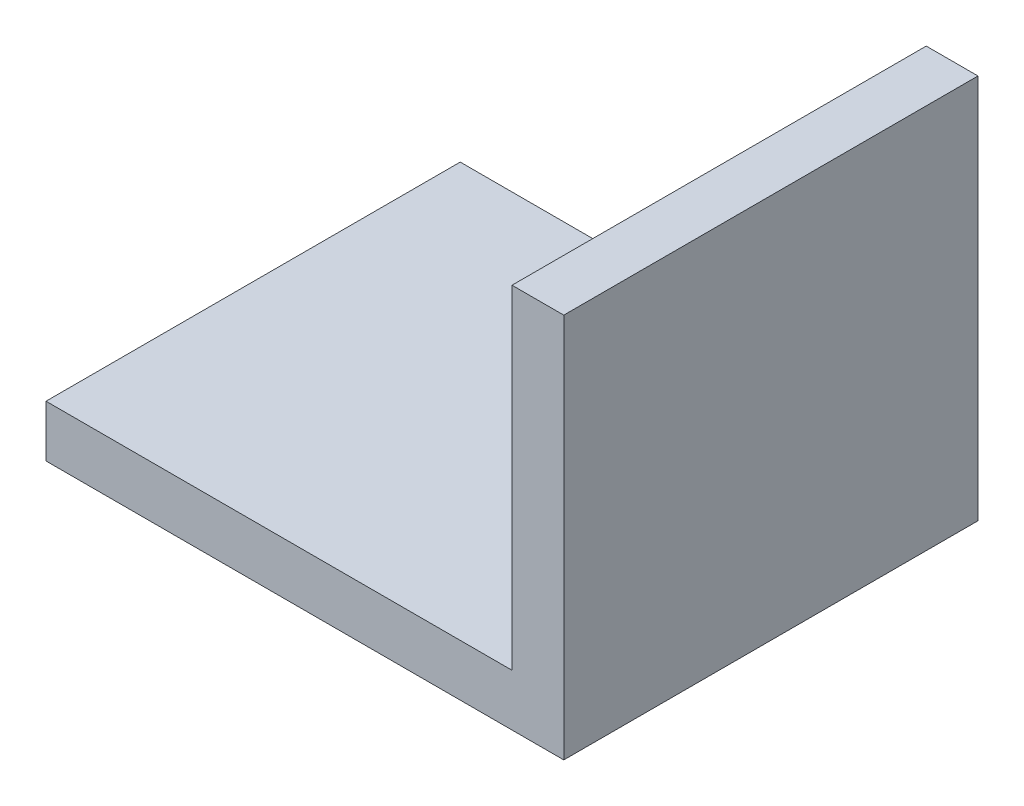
from build123d import *

# Parameters (mm, degrees)
BOSS_EXTRUDE1_DEPTH = 203.2


with BuildPart() as part:
    # Sketch1 → Boss-Extrude1 (new body)
    with BuildSketch(Plane.XY):
        Polygon((0, 0), (0, 25.4), (228.6, 25.4), (228.6, 188.976), (254, 188.976), (254, 0), align=None)
    extrude(amount=BOSS_EXTRUDE1_DEPTH)


solid = part.part
